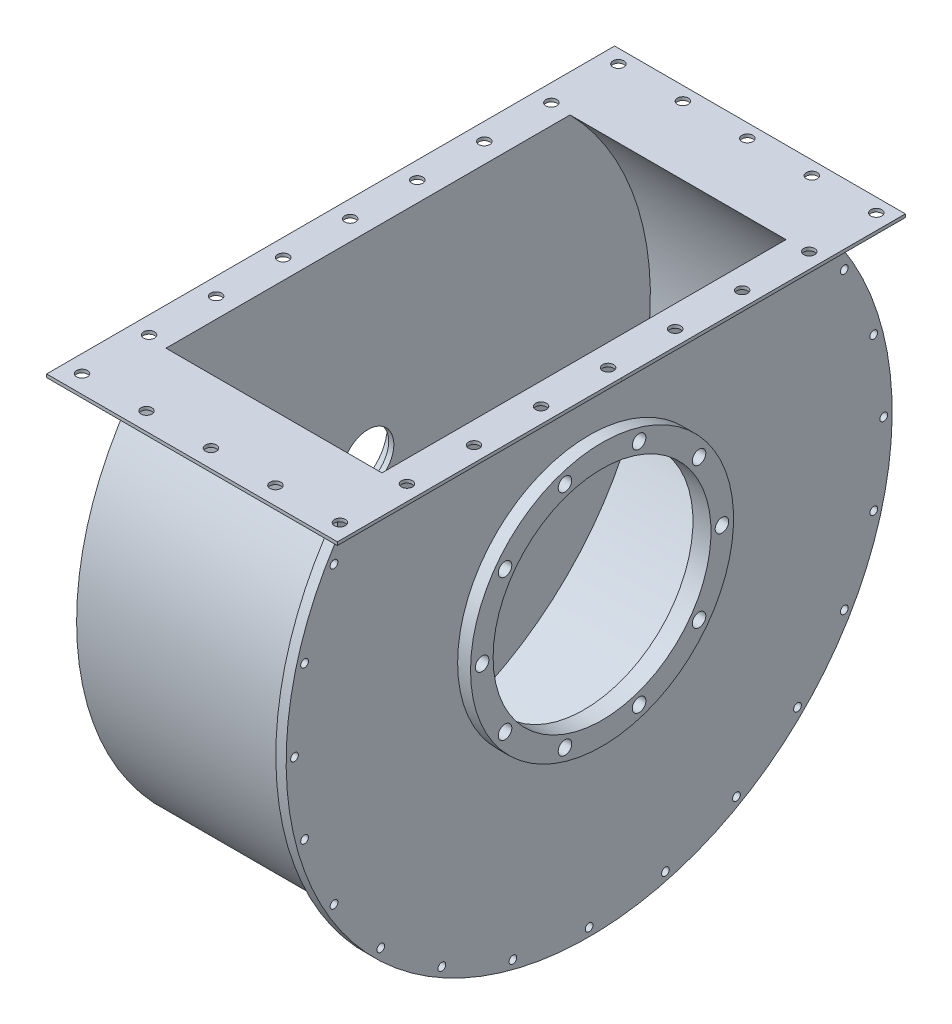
from build123d import *

# Parameters (mm, degrees)
CUT_EXTRUDE1_DEPTH   = 752.665484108
SKETCH7_W            = 351
SKETCH7_H            = 68.785841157
BOSS_EXTRUDE4_DEPTH  = 5
SKETCH8_R            = 8.5
CUT_EXTRUDE2_DEPTH   = 5
LPATTERN1_COUNT      = 5
LPATTERN1_PITCH      = 100
LPATTERN1_COUNT_DIR2 = 9
LPATTERN1_PITCH_DIR2 = 104
SKETCH9_R            = 10.5
CUT_EXTRUDE3_DEPTH   = 20
CIRPATTERN1_COUNT    = 10
SKETCH10_R           = 90
SKETCH10_R_2         = 60
BOSS_EXTRUDE5_DEPTH  = 22
SKETCH11_R           = 4
CUT_EXTRUDE4_DEPTH   = 22
CIRPATTERN2_COUNT    = 6
BOSS_EXTRUDE6_START  = 8
BOSS_EXTRUDE6_DEPTH  = 8
SKETCH13_R           = 6
CUT_EXTRUDE5_DEPTH   = 777.273791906
CIRPATTERN3_COUNT    = 24


with BuildPart() as part:
    # Sketch1 → Revolve1 (revolve)
    with BuildSketch(Plane.XY, mode=Mode.PRIVATE) as revolve1_sk:
        Polygon((171.5, -204), (171.5, -470), (163.5, -470), (163.5, -444), (-179.5, -444), (-179.5, -40), (-171.5, -40), (-171.5, -438), (163.5, -438), (163.5, -169), (191.5, -169), (191.5, -204), align=None)
    revolve(revolve1_sk.sketch.rotate(Axis((-163.5, 0, 0), (1, 0, 0)), 270), axis=Axis((-163.5, 0, 0), (1, 0, 0)))

    # Sketch2 → Cut-Extrude1 (cut, through all)
    with BuildSketch(Plane(origin=(171.5, 0, 0), x_dir=(0, 0, -1), z_dir=(1, 0, 0))):
        with BuildLine():
            Line((385.26354616, 306), (-385.26354616, 306))
            ThreePointArc((-385.26354616, 306), (0, 492), (385.26354616, 306))
        make_face()
    extrude(amount=-CUT_EXTRUDE1_DEPTH, mode=Mode.SUBTRACT)

    # Sweep2: sweep along a path in Sketch4
    with BuildLine(Plane(origin=(0, 306, 0), x_dir=(1, 0, 0), z_dir=(0, 1, 0))) as sweep2_path:
        Line((171.5, 390.5), (171.5, -390.5))
        Line((171.5, -390.5), (-179.5, -390.5))
        Line((-179.5, -390.5), (-179.5, 390.5))
        Line((-179.5, 390.5), (171.5, 390.5))
    # Sketch3 → Sweep2 (sweep)
    with BuildSketch(Plane.XY):
        Polygon((171.5, 256), (171.5, 306), (221.5, 306), (221.5, 301), (176.5, 301), (176.5, 256), align=None)
    sweep(path=sweep2_path.line, transition=Transition.RIGHT)

    # Sketch7 → Boss-Extrude4 (add)
    with BuildSketch(Plane(origin=(0, 306, 0), x_dir=(1, 0, 0), z_dir=(0, 1, 0))):
        with Locations((-4, -356.107079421)):
            Rectangle(SKETCH7_W, SKETCH7_H)
    boss_extrude4 = extrude(amount=-BOSS_EXTRUDE4_DEPTH)

    # Mirror5: Boss-Extrude4 across plane
    add(boss_extrude4.mirror(Plane.XY))

    # Sketch8 → Cut-Extrude2 (cut)
    with BuildSketch(Plane(origin=(0, 306, 0), x_dir=(1, 0, 0), z_dir=(0, 1, 0))):
        with Locations(Location((-202.412476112, -412.69608235, 0), (0, 0, 228.416629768))):
            Circle(SKETCH8_R)
    cut_extrude2 = extrude(amount=-CUT_EXTRUDE2_DEPTH, mode=Mode.SUBTRACT)

    # LPattern1: Cut-Extrude2 5 × 9, 21 skipped
    with Locations(*[(i * LPATTERN1_PITCH, 0, -j * LPATTERN1_PITCH_DIR2) for i in range(LPATTERN1_COUNT) for j in range(LPATTERN1_COUNT_DIR2) if (i, j) not in ((0, 0), (1, 1), (1, 2), (1, 3), (1, 4), (1, 5), (1, 6), (1, 7), (2, 1), (2, 2), (2, 3), (2, 4), (2, 5), (2, 6), (2, 7), (3, 1), (3, 2), (3, 3), (3, 4), (3, 5), (3, 6), (3, 7))]):
        add(cut_extrude2, mode=Mode.SUBTRACT)

    # Sketch9 → Cut-Extrude3 (cut)
    with BuildSketch(Plane(origin=(191.5, 0, 0), x_dir=(0, 0, -1), z_dir=(1, 0, 0))):
        with Locations((-186, 0)):
            Circle(SKETCH9_R)
    cut_extrude3 = extrude(amount=-CUT_EXTRUDE3_DEPTH, mode=Mode.SUBTRACT)

    # CirPattern1: Cut-Extrude3 ×10 about axis
    cirpattern1_axis = Axis((0, 0, 0), (1, 0, 0))
    for i in range(1, CIRPATTERN1_COUNT):
        add(cut_extrude3.rotate(cirpattern1_axis, i * 360 / CIRPATTERN1_COUNT), mode=Mode.SUBTRACT)

    # Sketch10 → Boss-Extrude5 (add)
    with BuildSketch(Plane.ZY.offset(179.5)):
        Circle(SKETCH10_R)
        Circle(SKETCH10_R_2, mode=Mode.SUBTRACT)
    extrude(amount=BOSS_EXTRUDE5_DEPTH)

    # Sketch11 → Cut-Extrude4 (cut)
    with BuildSketch(Plane.ZY.offset(201.5)):
        with Locations((0, 75)):
            Circle(SKETCH11_R)
    cut_extrude4 = extrude(amount=-CUT_EXTRUDE4_DEPTH, mode=Mode.SUBTRACT)

    # CirPattern2: Cut-Extrude4 ×6 about axis
    cirpattern2_axis = Axis((0, 0, 0), (1, 0, 0))
    for i in range(1, CIRPATTERN2_COUNT):
        add(cut_extrude4.rotate(cirpattern2_axis, i * 360 / CIRPATTERN2_COUNT), mode=Mode.SUBTRACT)

    # Sketch12 → Boss-Extrude6 (add)
    with BuildSketch(Plane.ZY.offset(-163.5).offset(BOSS_EXTRUDE6_START)):
        with BuildLine():
            Line((-360.9695278, 301), (-326.396997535, 301))
            ThreePointArc((-326.396997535, 301), (0, -444), (326.396997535, 301))
            Line((326.396997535, 301), (360.9695278, 301))
            ThreePointArc((360.9695278, 301), (0, -470), (-360.9695278, 301))
        make_face()
    extrude(amount=-BOSS_EXTRUDE6_DEPTH)

    # Sketch13 → Cut-Extrude5 (cut, through all)
    with BuildSketch(Plane(origin=(171.5, 0, 0), x_dir=(0, 0, -1), z_dir=(1, 0, 0))):
        with Locations((0, -457)):
            Circle(SKETCH13_R)
    cut_extrude5 = extrude(amount=-CUT_EXTRUDE5_DEPTH, mode=Mode.SUBTRACT)

    # CirPattern3: Cut-Extrude5 ×24 about axis, 7 skipped
    cirpattern3_axis = Axis((0, 0, 0), (-1, 0, 0))
    add([cut_extrude5.rotate(cirpattern3_axis, i * 360 / CIRPATTERN3_COUNT) for i in range(1, CIRPATTERN3_COUNT) if i not in (9, 10, 11, 12, 13, 14, 15)], mode=Mode.SUBTRACT)


solid = part.part
